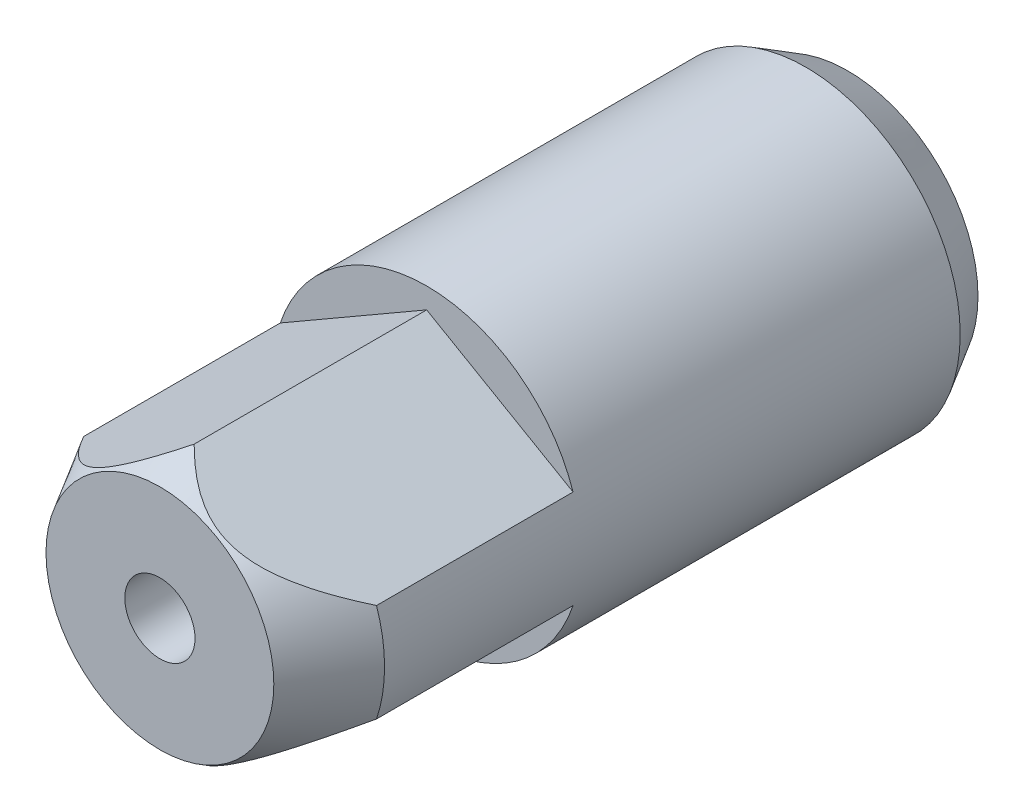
ISO-10303-21;
HEADER;
FILE_DESCRIPTION(('STEP AP214'),'2;1');
FILE_NAME('part.step','',(''),(''),'','','');
FILE_SCHEMA(('AUTOMOTIVE_DESIGN { 1 0 10303 214 1 1 1 1 }'));
ENDSEC;
DATA;
#1=APPLICATION_CONTEXT('core data for automotive mechanical design processes');
#2=APPLICATION_PROTOCOL_DEFINITION('international standard','automotive_design',2000,#1);
#3=PRODUCT_CONTEXT('',#1,'mechanical');
#4=PRODUCT('Part','Part','',(#3));
#5=PRODUCT_RELATED_PRODUCT_CATEGORY('part','',(#4));
#6=PRODUCT_DEFINITION_FORMATION('','',#4);
#7=PRODUCT_DEFINITION_CONTEXT('part definition',#1,'design');
#8=PRODUCT_DEFINITION('design','',#6,#7);
#9=PRODUCT_DEFINITION_SHAPE('','',#8);
#10=(LENGTH_UNIT() NAMED_UNIT(*) SI_UNIT(.MILLI.,.METRE.));
#11=(NAMED_UNIT(*) PLANE_ANGLE_UNIT() SI_UNIT($,.RADIAN.));
#12=(NAMED_UNIT(*) SI_UNIT($,.STERADIAN.) SOLID_ANGLE_UNIT());
#13=UNCERTAINTY_MEASURE_WITH_UNIT(LENGTH_MEASURE(1.E-05),#10,'distance_accuracy_value','');
#14=(GEOMETRIC_REPRESENTATION_CONTEXT(3) GLOBAL_UNCERTAINTY_ASSIGNED_CONTEXT((#13)) GLOBAL_UNIT_ASSIGNED_CONTEXT((#10,
#11,#12)) REPRESENTATION_CONTEXT('',''));
#15=CARTESIAN_POINT('',(0.,0.,0.));
#16=DIRECTION('',(0.,0.,1.));
#17=DIRECTION('',(1.,0.,0.));
#18=AXIS2_PLACEMENT_3D('',#15,#16,#17);
#19=CARTESIAN_POINT('',(0.,0.,44.));
#20=DIRECTION('',(0.,0.,-1.));
#21=DIRECTION('',(-1.,0.,0.));
#22=AXIS2_PLACEMENT_3D('',#19,#20,#21);
#23=CONICAL_SURFACE('',#22,11.,0.523598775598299);
#24=CARTESIAN_POINT('',(0.,0.,49.));
#25=DIRECTION('',(0.,0.,1.));
#26=DIRECTION('',(1.,0.,0.));
#27=AXIS2_PLACEMENT_3D('',#24,#25,#26);
#28=CIRCLE('',#27,8.11324865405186);
#29=CARTESIAN_POINT('',(8.11324865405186,0.,49.));
#30=VERTEX_POINT('',#29);
#31=EDGE_CURVE('E23',#30,#30,#28,.T.);
#32=ORIENTED_EDGE('',*,*,#31,.F.);
#33=EDGE_LOOP('',(#32));
#34=FACE_BOUND('',#33,.T.);
#35=CARTESIAN_POINT('',(-0.0002,9.52091275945,46.561854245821));
#36=CARTESIAN_POINT('',(0.0860249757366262,9.47113074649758,46.6480735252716));
#37=CARTESIAN_POINT('',(0.173110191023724,9.42085207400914,46.7331429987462));
#38=CARTESIAN_POINT('',(0.349190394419,9.31919212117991,46.9006618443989));
#39=CARTESIAN_POINT('',(0.438185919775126,9.26781053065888,46.9831104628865));
#40=CARTESIAN_POINT('',(0.709164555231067,9.11136094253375,47.2267956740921));
#41=CARTESIAN_POINT('',(0.894264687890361,9.00449333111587,47.3834860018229));
#42=CARTESIAN_POINT('',(1.27893484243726,8.782403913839,47.6847272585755));
#43=CARTESIAN_POINT('',(1.47875674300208,8.66703668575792,47.8288533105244));
#44=CARTESIAN_POINT('',(1.88922710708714,8.43005151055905,48.0941303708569));
#45=CARTESIAN_POINT('',(2.09985028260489,8.30844816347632,48.2153321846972));
#46=CARTESIAN_POINT('',(2.43365580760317,8.11572545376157,48.3790773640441));
#47=CARTESIAN_POINT('',(2.55292932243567,8.04686285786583,48.4322911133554));
#48=CARTESIAN_POINT('',(2.79459998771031,7.90733423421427,48.5284031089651));
#49=CARTESIAN_POINT('',(2.91699736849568,7.83666807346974,48.5713005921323));
#50=CARTESIAN_POINT('',(3.1634566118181,7.69437476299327,48.6451406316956));
#51=CARTESIAN_POINT('',(3.28749766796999,7.62275962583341,48.6761750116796));
#52=CARTESIAN_POINT('',(3.53744533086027,7.47845227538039,48.7256442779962));
#53=CARTESIAN_POINT('',(3.66335156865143,7.40576027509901,48.7440816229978));
#54=CARTESIAN_POINT('',(3.91731234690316,7.25913595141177,48.7677338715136));
#55=CARTESIAN_POINT('',(4.04537592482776,7.18519841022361,48.7728210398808));
#56=CARTESIAN_POINT('',(4.30135214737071,7.03741046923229,48.7691838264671));
#57=CARTESIAN_POINT('',(4.42926479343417,6.9635600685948,48.7604595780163));
#58=CARTESIAN_POINT('',(4.684082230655,6.81644115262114,48.7295470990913));
#59=CARTESIAN_POINT('',(4.81098482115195,6.74317390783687,48.7073349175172));
#60=CARTESIAN_POINT('',(5.06264079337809,6.59788026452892,48.6503198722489));
#61=CARTESIAN_POINT('',(5.18739385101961,6.52585405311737,48.6155151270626));
#62=CARTESIAN_POINT('',(5.46940994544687,6.36303198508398,48.5229371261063));
#63=CARTESIAN_POINT('',(5.62575581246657,6.27276565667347,48.4614409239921));
#64=CARTESIAN_POINT('',(5.93307167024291,6.09533676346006,48.3225351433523));
#65=CARTESIAN_POINT('',(6.08403828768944,6.00817614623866,48.245115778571));
#66=CARTESIAN_POINT('',(6.38165080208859,5.83634948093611,48.0764735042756));
#67=CARTESIAN_POINT('',(6.52824773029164,5.7517117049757,47.9851364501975));
#68=CARTESIAN_POINT('',(6.81591068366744,5.5856294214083,47.7916842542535));
#69=CARTESIAN_POINT('',(6.95697795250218,5.50418419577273,47.689571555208));
#70=CARTESIAN_POINT('',(7.25748890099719,5.3306841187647,47.4585691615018));
#71=CARTESIAN_POINT('',(7.41600158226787,5.2391667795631,47.3280726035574));
#72=CARTESIAN_POINT('',(7.72689739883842,5.05967099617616,47.0576449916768));
#73=CARTESIAN_POINT('',(7.87927857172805,4.97169368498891,46.917710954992));
#74=CARTESIAN_POINT('',(8.17897541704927,4.79866363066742,46.6300388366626));
#75=CARTESIAN_POINT('',(8.32627868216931,4.71361805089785,46.4822836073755));
#76=CARTESIAN_POINT('',(8.61616767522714,4.5462505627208,46.1807205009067));
#77=CARTESIAN_POINT('',(8.75875294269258,4.46392892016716,46.0269120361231));
#78=CARTESIAN_POINT('',(9.03345584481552,4.30532912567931,45.7214359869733));
#79=CARTESIAN_POINT('',(9.1657553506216,4.22894597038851,45.569985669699));
#80=CARTESIAN_POINT('',(9.42706872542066,4.07807662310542,45.2633417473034));
#81=CARTESIAN_POINT('',(9.55608239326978,4.00359054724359,45.1081479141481));
#82=CARTESIAN_POINT('',(9.81045397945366,3.85672904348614,44.7955601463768));
#83=CARTESIAN_POINT('',(9.93582909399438,3.78434368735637,44.6381848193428));
#84=CARTESIAN_POINT('',(10.1840139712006,3.64105408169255,44.3208180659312));
#85=CARTESIAN_POINT('',(10.3068242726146,3.57014952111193,44.1608272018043));
#86=CARTESIAN_POINT('',(10.4285268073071,3.49988452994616,43.9997352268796));
#87=B_SPLINE_CURVE_WITH_KNOTS('',3,(#35,#36,#37,#38,#39,#40,#41,#42,#43,#44,#45,#46,#47,#48,#49,
#50,#51,#52,#53,#54,#55,#56,#57,#58,#59,#60,#61,#62,#63,#64,#65,#66,#67,#68,#69,#70,#71,#72,#73,
#74,#75,#76,#77,#78,#79,#80,#81,#82,#83,#84,#85,#86),.UNSPECIFIED.,.F.,.F.,(4,2,2,2,2,2,2,2,2,2,
2,2,2,2,2,2,2,2,2,2,2,2,2,2,2,4),(0.,0.395103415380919,0.790319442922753,1.58477697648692,
2.40002064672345,3.21343581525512,3.65604476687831,4.09868644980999,4.53782903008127,
4.97688587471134,5.42012857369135,5.8633669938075,6.30739480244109,6.75148898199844,
7.3227165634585,7.89429627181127,8.47084475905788,9.0472628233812,9.72124464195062,
10.3954404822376,11.0711811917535,11.7469876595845,12.3922592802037,13.0375703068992,
13.6790381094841,14.3203697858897),.UNSPECIFIED.);
#88=CARTESIAN_POINT('',(0.,9.52079728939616,46.5620542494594));
#89=VERTEX_POINT('',#88);
#90=CARTESIAN_POINT('',(10.4283268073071,3.5,44.));
#91=VERTEX_POINT('',#90);
#92=EDGE_CURVE('E102',#89,#91,#87,.T.);
#93=ORIENTED_EDGE('',*,*,#92,.F.);
#94=CARTESIAN_POINT('',(0.0002,9.52091275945,46.561854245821));
#95=CARTESIAN_POINT('',(-0.0860249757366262,9.47113074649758,46.6480735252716));
#96=CARTESIAN_POINT('',(-0.173110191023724,9.42085207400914,46.7331429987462));
#97=CARTESIAN_POINT('',(-0.349190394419,9.31919212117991,46.9006618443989));
#98=CARTESIAN_POINT('',(-0.438185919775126,9.26781053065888,46.9831104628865));
#99=CARTESIAN_POINT('',(-0.709164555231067,9.11136094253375,47.2267956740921));
#100=CARTESIAN_POINT('',(-0.894264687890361,9.00449333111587,47.3834860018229));
#101=CARTESIAN_POINT('',(-1.27893484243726,8.782403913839,47.6847272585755));
#102=CARTESIAN_POINT('',(-1.47875674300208,8.66703668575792,47.8288533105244));
#103=CARTESIAN_POINT('',(-1.88922710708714,8.43005151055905,48.0941303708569));
#104=CARTESIAN_POINT('',(-2.09985028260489,8.30844816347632,48.2153321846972));
#105=CARTESIAN_POINT('',(-2.43365580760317,8.11572545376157,48.3790773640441));
#106=CARTESIAN_POINT('',(-2.55292932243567,8.04686285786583,48.4322911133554));
#107=CARTESIAN_POINT('',(-2.79459998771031,7.90733423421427,48.5284031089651));
#108=CARTESIAN_POINT('',(-2.91699736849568,7.83666807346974,48.5713005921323));
#109=CARTESIAN_POINT('',(-3.1634566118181,7.69437476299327,48.6451406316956));
#110=CARTESIAN_POINT('',(-3.28749766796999,7.62275962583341,48.6761750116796));
#111=CARTESIAN_POINT('',(-3.53744533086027,7.47845227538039,48.7256442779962));
#112=CARTESIAN_POINT('',(-3.66335156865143,7.40576027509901,48.7440816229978));
#113=CARTESIAN_POINT('',(-3.91731234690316,7.25913595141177,48.7677338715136));
#114=CARTESIAN_POINT('',(-4.04537592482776,7.18519841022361,48.7728210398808));
#115=CARTESIAN_POINT('',(-4.30135214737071,7.03741046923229,48.7691838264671));
#116=CARTESIAN_POINT('',(-4.42926479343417,6.9635600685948,48.7604595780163));
#117=CARTESIAN_POINT('',(-4.684082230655,6.81644115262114,48.7295470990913));
#118=CARTESIAN_POINT('',(-4.81098482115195,6.74317390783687,48.7073349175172));
#119=CARTESIAN_POINT('',(-5.06264079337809,6.59788026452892,48.6503198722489));
#120=CARTESIAN_POINT('',(-5.18739385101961,6.52585405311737,48.6155151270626));
#121=CARTESIAN_POINT('',(-5.46940994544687,6.36303198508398,48.5229371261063));
#122=CARTESIAN_POINT('',(-5.62575581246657,6.27276565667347,48.4614409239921));
#123=CARTESIAN_POINT('',(-5.93307167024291,6.09533676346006,48.3225351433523));
#124=CARTESIAN_POINT('',(-6.08403828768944,6.00817614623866,48.245115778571));
#125=CARTESIAN_POINT('',(-6.38165080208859,5.83634948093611,48.0764735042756));
#126=CARTESIAN_POINT('',(-6.52824773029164,5.7517117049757,47.9851364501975));
#127=CARTESIAN_POINT('',(-6.81591068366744,5.5856294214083,47.7916842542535));
#128=CARTESIAN_POINT('',(-6.95697795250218,5.50418419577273,47.689571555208));
#129=CARTESIAN_POINT('',(-7.25748890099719,5.3306841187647,47.4585691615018));
#130=CARTESIAN_POINT('',(-7.41600158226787,5.2391667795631,47.3280726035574));
#131=CARTESIAN_POINT('',(-7.72689739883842,5.05967099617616,47.0576449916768));
#132=CARTESIAN_POINT('',(-7.87927857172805,4.97169368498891,46.917710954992));
#133=CARTESIAN_POINT('',(-8.17897541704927,4.79866363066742,46.6300388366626));
#134=CARTESIAN_POINT('',(-8.32627868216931,4.71361805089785,46.4822836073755));
#135=CARTESIAN_POINT('',(-8.61616767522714,4.5462505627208,46.1807205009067));
#136=CARTESIAN_POINT('',(-8.75875294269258,4.46392892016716,46.0269120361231));
#137=CARTESIAN_POINT('',(-9.03345584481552,4.30532912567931,45.7214359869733));
#138=CARTESIAN_POINT('',(-9.1657553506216,4.22894597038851,45.569985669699));
#139=CARTESIAN_POINT('',(-9.42706872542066,4.07807662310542,45.2633417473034));
#140=CARTESIAN_POINT('',(-9.55608239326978,4.00359054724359,45.1081479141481));
#141=CARTESIAN_POINT('',(-9.81045397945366,3.85672904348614,44.7955601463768));
#142=CARTESIAN_POINT('',(-9.93582909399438,3.78434368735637,44.6381848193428));
#143=CARTESIAN_POINT('',(-10.1840139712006,3.64105408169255,44.3208180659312));
#144=CARTESIAN_POINT('',(-10.3068242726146,3.57014952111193,44.1608272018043));
#145=CARTESIAN_POINT('',(-10.4285268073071,3.49988452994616,43.9997352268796));
#146=B_SPLINE_CURVE_WITH_KNOTS('',3,(#94,#95,#96,#97,#98,#99,#100,#101,#102,#103,#104,#105,#106,
#107,#108,#109,#110,#111,#112,#113,#114,#115,#116,#117,#118,#119,#120,#121,#122,#123,#124,#125,
#126,#127,#128,#129,#130,#131,#132,#133,#134,#135,#136,#137,#138,#139,#140,#141,#142,#143,#144,
#145),.UNSPECIFIED.,.F.,.F.,(4,2,2,2,2,2,2,2,2,2,2,2,2,2,2,2,2,2,2,2,2,2,2,2,2,4),(0.,
0.395103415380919,0.790319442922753,1.58477697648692,2.40002064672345,3.21343581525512,
3.65604476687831,4.09868644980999,4.53782903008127,4.97688587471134,5.42012857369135,
5.8633669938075,6.30739480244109,6.75148898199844,7.3227165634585,7.89429627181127,
8.47084475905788,9.0472628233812,9.72124464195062,10.3954404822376,11.0711811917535,
11.7469876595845,12.3922592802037,13.0375703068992,13.6790381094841,14.3203697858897),.UNSPECIFIED.);
#147=CARTESIAN_POINT('',(-10.4283268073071,3.5,44.));
#148=VERTEX_POINT('',#147);
#149=EDGE_CURVE('E75',#89,#148,#146,.T.);
#150=ORIENTED_EDGE('',*,*,#149,.T.);
#151=CARTESIAN_POINT('',(0.,0.,44.));
#152=DIRECTION('',(0.,0.,1.));
#153=DIRECTION('',(1.,0.,0.));
#154=AXIS2_PLACEMENT_3D('',#151,#152,#153);
#155=CIRCLE('',#154,11.);
#156=CARTESIAN_POINT('',(-10.4283268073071,-3.5,44.));
#157=VERTEX_POINT('',#156);
#158=EDGE_CURVE('E155',#148,#157,#155,.T.);
#159=ORIENTED_EDGE('',*,*,#158,.T.);
#160=CARTESIAN_POINT('',(0.000199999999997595,-9.52091275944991,46.5618542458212));
#161=CARTESIAN_POINT('',(-0.0860249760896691,-9.4711307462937,46.6480735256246));
#162=CARTESIAN_POINT('',(-0.173110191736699,-9.42085207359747,46.7331429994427));
#163=CARTESIAN_POINT('',(-0.349190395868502,-9.31919212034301,46.9006618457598));
#164=CARTESIAN_POINT('',(-0.438185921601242,-9.26781052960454,46.9831104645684));
#165=CARTESIAN_POINT('',(-0.709164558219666,-9.11136094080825,47.2267956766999));
#166=CARTESIAN_POINT('',(-0.894264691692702,-9.00449332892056,47.3834860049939));
#167=CARTESIAN_POINT('',(-1.27893484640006,-8.78240391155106,47.6847272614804));
#168=CARTESIAN_POINT('',(-1.47875674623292,-8.66703668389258,47.8288533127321));
#169=CARTESIAN_POINT('',(-1.88922710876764,-8.43005150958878,48.0941303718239));
#170=CARTESIAN_POINT('',(-2.09985028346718,-8.30844816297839,48.2153321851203));
#171=CARTESIAN_POINT('',(-2.43365580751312,-8.11572545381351,48.379077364));
#172=CARTESIAN_POINT('',(-2.55292932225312,-8.04686285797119,48.432291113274));
#173=CARTESIAN_POINT('',(-2.79459998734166,-7.9073342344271,48.5284031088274));
#174=CARTESIAN_POINT('',(-2.91699736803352,-7.83666807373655,48.5713005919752));
#175=CARTESIAN_POINT('',(-3.16345661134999,-7.69437476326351,48.6451406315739));
#176=CARTESIAN_POINT('',(-3.28749766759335,-7.62275962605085,48.6761750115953));
#177=CARTESIAN_POINT('',(-3.53744533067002,-7.4784522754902,48.7256442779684));
#178=CARTESIAN_POINT('',(-3.6633515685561,-7.405760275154,48.744081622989));
#179=CARTESIAN_POINT('',(-3.91731234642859,-7.25913595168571,48.7677338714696));
#180=CARTESIAN_POINT('',(-4.04537592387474,-7.18519841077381,48.7728210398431));
#181=CARTESIAN_POINT('',(-4.30135214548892,-7.03741047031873,48.7691838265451));
#182=CARTESIAN_POINT('',(-4.42926479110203,-6.96356006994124,48.760459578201));
#183=CARTESIAN_POINT('',(-4.68408222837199,-6.81644115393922,48.7295470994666));
#184=CARTESIAN_POINT('',(-4.81098481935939,-6.74317390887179,48.7073349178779));
#185=CARTESIAN_POINT('',(-5.06264079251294,-6.5978802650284,48.6503198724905));
#186=CARTESIAN_POINT('',(-5.18739385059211,-6.52585405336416,48.6155151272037));
#187=CARTESIAN_POINT('',(-5.46940995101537,-6.36303198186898,48.5229371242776));
#188=CARTESIAN_POINT('',(-5.62575582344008,-6.2727656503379,48.4614409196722));
#189=CARTESIAN_POINT('',(-5.93307169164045,-6.09533675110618,48.3225351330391));
#190=CARTESIAN_POINT('',(-6.08403831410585,-6.00817613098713,48.2451157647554));
#191=CARTESIAN_POINT('',(-6.38165082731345,-5.83634946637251,48.0764734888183));
#192=CARTESIAN_POINT('',(-6.52824774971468,-5.7517116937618,47.9851364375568));
#193=CARTESIAN_POINT('',(-6.81591069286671,-5.58562941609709,47.7916842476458));
#194=CARTESIAN_POINT('',(-6.95697795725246,-5.50418419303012,47.6895715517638));
#195=CARTESIAN_POINT('',(-7.25748618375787,-5.33068568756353,47.458571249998));
#196=CARTESIAN_POINT('',(-7.41599626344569,-5.23916985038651,47.3280769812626));
#197=CARTESIAN_POINT('',(-7.72688706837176,-5.05967696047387,47.0576542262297));
#198=CARTESIAN_POINT('',(-7.87926583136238,-4.97170104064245,46.9177227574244));
#199=CARTESIAN_POINT('',(-8.1789579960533,-4.79867368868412,46.630055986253));
#200=CARTESIAN_POINT('',(-8.32625899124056,-4.71362941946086,46.4823035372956));
#201=CARTESIAN_POINT('',(-8.61614357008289,-4.54626447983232,46.1807461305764));
#202=CARTESIAN_POINT('',(-8.75872669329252,-4.46394407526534,46.0269405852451));
#203=CARTESIAN_POINT('',(-9.03342564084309,-4.30534656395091,45.7214701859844));
#204=CARTESIAN_POINT('',(-9.16572332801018,-4.22896445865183,45.5700225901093));
#205=CARTESIAN_POINT('',(-9.42703313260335,-4.07809717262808,45.263384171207));
#206=CARTESIAN_POINT('',(-9.55604504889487,-4.0036121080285,45.1081931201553));
#207=CARTESIAN_POINT('',(-9.81041322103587,-3.85675257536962,44.7956109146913));
#208=CARTESIAN_POINT('',(-9.9357866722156,-3.78436817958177,44.6382383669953));
#209=CARTESIAN_POINT('',(-10.1839682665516,-3.64108046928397,44.320877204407));
#210=CARTESIAN_POINT('',(-10.3067769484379,-3.57017684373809,44.1608891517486));
#211=CARTESIAN_POINT('',(-10.4284778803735,-3.49991277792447,43.9998));
#212=B_SPLINE_CURVE_WITH_KNOTS('',3,(#160,#161,#162,#163,#164,#165,#166,#167,#168,#169,#170,
#171,#172,#173,#174,#175,#176,#177,#178,#179,#180,#181,#182,#183,#184,#185,#186,#187,#188,#189,
#190,#191,#192,#193,#194,#195,#196,#197,#198,#199,#200,#201,#202,#203,#204,#205,#206,#207,#208,
#209,#210,#211),.UNSPECIFIED.,.F.,.F.,(4,2,2,2,2,2,2,2,2,2,2,2,2,2,2,2,2,2,2,2,2,2,2,2,2,4),(0.,
0.39510341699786,0.79031944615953,1.58477698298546,2.40002064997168,3.21343581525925,
3.65604476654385,4.09868644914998,4.53782902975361,4.97688587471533,5.42012857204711,
5.86336699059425,6.30739480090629,6.75148898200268,7.32271658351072,7.89429631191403,
8.47084477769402,9.04726282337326,9.72123333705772,10.3954178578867,11.071147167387,
11.7469422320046,12.3922036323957,13.0375044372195,13.6789622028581,14.3202838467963),.UNSPECIFIED.);
#213=CARTESIAN_POINT('',(0.,-9.52079728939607,46.5620542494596));
#214=VERTEX_POINT('',#213);
#215=EDGE_CURVE('E129',#214,#157,#212,.T.);
#216=ORIENTED_EDGE('',*,*,#215,.F.);
#217=CARTESIAN_POINT('',(-0.000200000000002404,-9.52091275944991,46.5618542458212));
#218=CARTESIAN_POINT('',(0.0860249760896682,-9.47113074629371,46.6480735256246));
#219=CARTESIAN_POINT('',(0.173110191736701,-9.42085207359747,46.7331429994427));
#220=CARTESIAN_POINT('',(0.349190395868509,-9.31919212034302,46.9006618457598));
#221=CARTESIAN_POINT('',(0.438185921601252,-9.26781052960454,46.9831104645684));
#222=CARTESIAN_POINT('',(0.709164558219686,-9.11136094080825,47.2267956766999));
#223=CARTESIAN_POINT('',(0.894264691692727,-9.00449332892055,47.383486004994));
#224=CARTESIAN_POINT('',(1.2789348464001,-8.78240391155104,47.6847272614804));
#225=CARTESIAN_POINT('',(1.47875674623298,-8.66703668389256,47.8288533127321));
#226=CARTESIAN_POINT('',(1.88922710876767,-8.43005150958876,48.0941303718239));
#227=CARTESIAN_POINT('',(2.09985028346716,-8.3084481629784,48.2153321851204));
#228=CARTESIAN_POINT('',(2.43365580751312,-8.11572545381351,48.3790773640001));
#229=CARTESIAN_POINT('',(2.55292932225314,-8.04686285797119,48.432291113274));
#230=CARTESIAN_POINT('',(2.79459998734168,-7.9073342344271,48.5284031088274));
#231=CARTESIAN_POINT('',(2.91699736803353,-7.83666807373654,48.5713005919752));
#232=CARTESIAN_POINT('',(3.16345661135,-7.69437476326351,48.6451406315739));
#233=CARTESIAN_POINT('',(3.28749766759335,-7.62275962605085,48.6761750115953));
#234=CARTESIAN_POINT('',(3.53744533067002,-7.4784522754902,48.7256442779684));
#235=CARTESIAN_POINT('',(3.6633515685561,-7.405760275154,48.744081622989));
#236=CARTESIAN_POINT('',(3.91731234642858,-7.25913595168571,48.7677338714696));
#237=CARTESIAN_POINT('',(4.04537592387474,-7.18519841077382,48.7728210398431));
#238=CARTESIAN_POINT('',(4.30135214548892,-7.03741047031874,48.7691838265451));
#239=CARTESIAN_POINT('',(4.42926479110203,-6.96356006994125,48.760459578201));
#240=CARTESIAN_POINT('',(4.68408222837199,-6.81644115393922,48.7295470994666));
#241=CARTESIAN_POINT('',(4.81098481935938,-6.7431739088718,48.7073349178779));
#242=CARTESIAN_POINT('',(5.06264079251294,-6.59788026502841,48.6503198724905));
#243=CARTESIAN_POINT('',(5.1873938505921,-6.52585405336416,48.6155151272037));
#244=CARTESIAN_POINT('',(5.46940995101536,-6.36303198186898,48.5229371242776));
#245=CARTESIAN_POINT('',(5.62575582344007,-6.2727656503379,48.4614409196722));
#246=CARTESIAN_POINT('',(5.93307169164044,-6.09533675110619,48.3225351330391));
#247=CARTESIAN_POINT('',(6.08403831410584,-6.00817613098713,48.2451157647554));
#248=CARTESIAN_POINT('',(6.38165082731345,-5.83634946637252,48.0764734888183));
#249=CARTESIAN_POINT('',(6.52824774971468,-5.7517116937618,47.9851364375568));
#250=CARTESIAN_POINT('',(6.8159106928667,-5.5856294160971,47.7916842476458));
#251=CARTESIAN_POINT('',(6.95697795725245,-5.50418419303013,47.6895715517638));
#252=CARTESIAN_POINT('',(7.25748618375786,-5.33068568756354,47.458571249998));
#253=CARTESIAN_POINT('',(7.41599626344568,-5.23916985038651,47.3280769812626));
#254=CARTESIAN_POINT('',(7.72688706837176,-5.05967696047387,47.0576542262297));
#255=CARTESIAN_POINT('',(7.87926583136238,-4.97170104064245,46.9177227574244));
#256=CARTESIAN_POINT('',(8.1789579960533,-4.79867368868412,46.6300559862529));
#257=CARTESIAN_POINT('',(8.32625899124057,-4.71362941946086,46.4823035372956));
#258=CARTESIAN_POINT('',(8.6161435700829,-4.54626447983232,46.1807461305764));
#259=CARTESIAN_POINT('',(8.75872669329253,-4.46394407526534,46.026940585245));
#260=CARTESIAN_POINT('',(9.0334256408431,-4.30534656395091,45.7214701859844));
#261=CARTESIAN_POINT('',(9.16572332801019,-4.22896445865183,45.5700225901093));
#262=CARTESIAN_POINT('',(9.42703313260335,-4.07809717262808,45.263384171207));
#263=CARTESIAN_POINT('',(9.55604504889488,-4.00361210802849,45.1081931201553));
#264=CARTESIAN_POINT('',(9.81041322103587,-3.85675257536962,44.7956109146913));
#265=CARTESIAN_POINT('',(9.9357866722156,-3.78436817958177,44.6382383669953));
#266=CARTESIAN_POINT('',(10.1839682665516,-3.64108046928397,44.320877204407));
#267=CARTESIAN_POINT('',(10.3067769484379,-3.57017684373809,44.1608891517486));
#268=CARTESIAN_POINT('',(10.4284778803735,-3.49991277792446,43.9998));
#269=B_SPLINE_CURVE_WITH_KNOTS('',3,(#217,#218,#219,#220,#221,#222,#223,#224,#225,#226,#227,
#228,#229,#230,#231,#232,#233,#234,#235,#236,#237,#238,#239,#240,#241,#242,#243,#244,#245,#246,
#247,#248,#249,#250,#251,#252,#253,#254,#255,#256,#257,#258,#259,#260,#261,#262,#263,#264,#265,
#266,#267,#268),.UNSPECIFIED.,.F.,.F.,(4,2,2,2,2,2,2,2,2,2,2,2,2,2,2,2,2,2,2,2,2,2,2,2,2,4),(0.,
0.39510341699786,0.790319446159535,1.5847769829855,2.40002064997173,3.2134358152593,
3.65604476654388,4.09868644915,4.53782902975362,4.97688587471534,5.42012857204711,
5.86336699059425,6.30739480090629,6.75148898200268,7.32271658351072,7.89429631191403,
8.47084477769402,9.04726282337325,9.72123333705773,10.3954178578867,11.071147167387,
11.7469422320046,12.3922036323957,13.0375044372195,13.6789622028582,14.3202838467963),.UNSPECIFIED.);
#270=CARTESIAN_POINT('',(10.4283268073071,-3.5,44.));
#271=VERTEX_POINT('',#270);
#272=EDGE_CURVE('E138',#214,#271,#269,.T.);
#273=ORIENTED_EDGE('',*,*,#272,.T.);
#274=EDGE_CURVE('E156',#271,#91,#155,.T.);
#275=ORIENTED_EDGE('',*,*,#274,.T.);
#276=EDGE_LOOP('',(#93,#150,#159,#216,#273,#275));
#277=FACE_BOUND('',#276,.T.);
#278=ADVANCED_FACE('F15',(#34,#277),#23,.T.);
#279=CARTESIAN_POINT('',(0.,0.,30.));
#280=DIRECTION('',(0.,0.,1.));
#281=DIRECTION('',(1.,0.,0.));
#282=AXIS2_PLACEMENT_3D('',#279,#280,#281);
#283=CYLINDRICAL_SURFACE('',#282,11.);
#284=CARTESIAN_POINT('',(0.,0.,3.));
#285=DIRECTION('',(0.,0.,1.));
#286=DIRECTION('',(1.,0.,0.));
#287=AXIS2_PLACEMENT_3D('',#284,#285,#286);
#288=CIRCLE('',#287,11.);
#289=CARTESIAN_POINT('',(11.,0.,3.));
#290=VERTEX_POINT('',#289);
#291=EDGE_CURVE('E152',#290,#290,#288,.T.);
#292=ORIENTED_EDGE('',*,*,#291,.T.);
#293=EDGE_LOOP('',(#292));
#294=FACE_BOUND('',#293,.T.);
#295=DIRECTION('',(0.,0.,1.));
#296=VECTOR('',#295,1.);
#297=CARTESIAN_POINT('',(10.4283268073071,3.5,30.));
#298=LINE('',#297,#296);
#299=CARTESIAN_POINT('',(10.4283268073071,3.5,30.));
#300=VERTEX_POINT('',#299);
#301=EDGE_CURVE('E82',#300,#91,#298,.T.);
#302=ORIENTED_EDGE('',*,*,#301,.T.);
#303=ORIENTED_EDGE('',*,*,#274,.F.);
#304=DIRECTION('',(0.,0.,1.));
#305=VECTOR('',#304,1.);
#306=CARTESIAN_POINT('',(10.4283268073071,-3.5,30.));
#307=LINE('',#306,#305);
#308=CARTESIAN_POINT('',(10.4283268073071,-3.5,30.));
#309=VERTEX_POINT('',#308);
#310=EDGE_CURVE('E179',#309,#271,#307,.T.);
#311=ORIENTED_EDGE('',*,*,#310,.F.);
#312=CARTESIAN_POINT('',(0.,0.,30.));
#313=DIRECTION('',(0.,0.,1.));
#314=DIRECTION('',(1.,0.,0.));
#315=AXIS2_PLACEMENT_3D('',#312,#313,#314);
#316=CIRCLE('',#315,11.);
#317=CARTESIAN_POINT('',(-10.4283268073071,-3.5,30.));
#318=VERTEX_POINT('',#317);
#319=EDGE_CURVE('E169',#318,#309,#316,.T.);
#320=ORIENTED_EDGE('',*,*,#319,.F.);
#321=DIRECTION('',(0.,0.,1.));
#322=VECTOR('',#321,1.);
#323=CARTESIAN_POINT('',(-10.4283268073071,-3.5,30.));
#324=LINE('',#323,#322);
#325=EDGE_CURVE('E176',#318,#157,#324,.T.);
#326=ORIENTED_EDGE('',*,*,#325,.T.);
#327=ORIENTED_EDGE('',*,*,#158,.F.);
#328=DIRECTION('',(0.,0.,1.));
#329=VECTOR('',#328,1.);
#330=CARTESIAN_POINT('',(-10.4283268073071,3.5,30.));
#331=LINE('',#330,#329);
#332=CARTESIAN_POINT('',(-10.4283268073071,3.5,30.));
#333=VERTEX_POINT('',#332);
#334=EDGE_CURVE('E78',#333,#148,#331,.T.);
#335=ORIENTED_EDGE('',*,*,#334,.F.);
#336=CARTESIAN_POINT('',(0.,0.,30.));
#337=DIRECTION('',(0.,0.,1.));
#338=DIRECTION('',(1.,0.,0.));
#339=AXIS2_PLACEMENT_3D('',#336,#337,#338);
#340=CIRCLE('',#339,11.);
#341=EDGE_CURVE('E86',#300,#333,#340,.T.);
#342=ORIENTED_EDGE('',*,*,#341,.F.);
#343=EDGE_LOOP('',(#302,#303,#311,#320,#326,#327,#335,#342));
#344=FACE_BOUND('',#343,.T.);
#345=ADVANCED_FACE('F165',(#294,#344),#283,.T.);
#346=CARTESIAN_POINT('',(0.,0.,30.));
#347=DIRECTION('',(0.,0.,1.));
#348=DIRECTION('',(1.,0.,0.));
#349=AXIS2_PLACEMENT_3D('',#346,#347,#348);
#350=CYLINDRICAL_SURFACE('',#349,2.5);
#351=CARTESIAN_POINT('',(0.,0.,39.));
#352=DIRECTION('',(0.,0.,1.));
#353=DIRECTION('',(1.,0.,0.));
#354=AXIS2_PLACEMENT_3D('',#351,#352,#353);
#355=CIRCLE('',#354,2.5);
#356=CARTESIAN_POINT('',(2.5,0.,39.));
#357=VERTEX_POINT('',#356);
#358=EDGE_CURVE('E89',#357,#357,#355,.T.);
#359=ORIENTED_EDGE('',*,*,#358,.F.);
#360=EDGE_LOOP('',(#359));
#361=FACE_BOUND('',#360,.T.);
#362=CARTESIAN_POINT('',(0.,0.,49.));
#363=DIRECTION('',(0.,0.,1.));
#364=DIRECTION('',(1.,0.,0.));
#365=AXIS2_PLACEMENT_3D('',#362,#363,#364);
#366=CIRCLE('',#365,2.5);
#367=CARTESIAN_POINT('',(2.5,0.,49.));
#368=VERTEX_POINT('',#367);
#369=EDGE_CURVE('E9',#368,#368,#366,.T.);
#370=ORIENTED_EDGE('',*,*,#369,.T.);
#371=EDGE_LOOP('',(#370));
#372=FACE_BOUND('',#371,.T.);
#373=ADVANCED_FACE('F17',(#361,#372),#350,.F.);
#374=CARTESIAN_POINT('',(8.11324865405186,0.,49.));
#375=DIRECTION('',(0.,0.,-1.));
#376=DIRECTION('',(-1.,0.,0.));
#377=AXIS2_PLACEMENT_3D('',#374,#375,#376);
#378=PLANE('',#377);
#379=ORIENTED_EDGE('',*,*,#369,.F.);
#380=EDGE_LOOP('',(#379));
#381=FACE_BOUND('',#380,.T.);
#382=ORIENTED_EDGE('',*,*,#31,.T.);
#383=EDGE_LOOP('',(#382));
#384=FACE_BOUND('',#383,.T.);
#385=ADVANCED_FACE('F161',(#381,#384),#378,.F.);
#386=CARTESIAN_POINT('',(0.,0.,0.));
#387=DIRECTION('',(0.,0.,1.));
#388=DIRECTION('',(1.,0.,0.));
#389=AXIS2_PLACEMENT_3D('',#386,#387,#388);
#390=CONICAL_SURFACE('',#389,9.26794919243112,0.523598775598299);
#391=ORIENTED_EDGE('',*,*,#291,.F.);
#392=EDGE_LOOP('',(#391));
#393=FACE_BOUND('',#392,.T.);
#394=CARTESIAN_POINT('',(0.,0.,0.));
#395=DIRECTION('',(0.,0.,1.));
#396=DIRECTION('',(1.,0.,0.));
#397=AXIS2_PLACEMENT_3D('',#394,#395,#396);
#398=CIRCLE('',#397,9.26794919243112);
#399=CARTESIAN_POINT('',(9.26794919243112,0.,0.));
#400=VERTEX_POINT('',#399);
#401=EDGE_CURVE('E149',#400,#400,#398,.T.);
#402=ORIENTED_EDGE('',*,*,#401,.T.);
#403=EDGE_LOOP('',(#402));
#404=FACE_BOUND('',#403,.T.);
#405=ADVANCED_FACE('F252',(#393,#404),#390,.T.);
#406=CARTESIAN_POINT('',(1.,0.,0.));
#407=DIRECTION('',(0.,0.,1.));
#408=DIRECTION('',(1.,0.,0.));
#409=AXIS2_PLACEMENT_3D('',#406,#407,#408);
#410=PLANE('',#409);
#411=ORIENTED_EDGE('',*,*,#401,.F.);
#412=EDGE_LOOP('',(#411));
#413=FACE_BOUND('',#412,.T.);
#414=CARTESIAN_POINT('',(0.,0.,0.));
#415=DIRECTION('',(0.,0.,1.));
#416=DIRECTION('',(1.,0.,0.));
#417=AXIS2_PLACEMENT_3D('',#414,#415,#416);
#418=CIRCLE('',#417,1.);
#419=CARTESIAN_POINT('',(1.,0.,0.));
#420=VERTEX_POINT('',#419);
#421=EDGE_CURVE('E146',#420,#420,#418,.T.);
#422=ORIENTED_EDGE('',*,*,#421,.T.);
#423=EDGE_LOOP('',(#422));
#424=FACE_BOUND('',#423,.T.);
#425=ADVANCED_FACE('F257',(#413,#424),#410,.F.);
#426=CARTESIAN_POINT('',(0.,0.,30.));
#427=DIRECTION('',(0.,0.,1.));
#428=DIRECTION('',(1.,0.,0.));
#429=AXIS2_PLACEMENT_3D('',#426,#427,#428);
#430=CYLINDRICAL_SURFACE('',#429,1.);
#431=ORIENTED_EDGE('',*,*,#421,.F.);
#432=EDGE_LOOP('',(#431));
#433=FACE_BOUND('',#432,.T.);
#434=CARTESIAN_POINT('',(0.,0.,4.));
#435=DIRECTION('',(0.,0.,1.));
#436=DIRECTION('',(1.,0.,0.));
#437=AXIS2_PLACEMENT_3D('',#434,#435,#436);
#438=CIRCLE('',#437,1.);
#439=CARTESIAN_POINT('',(1.,0.,4.));
#440=VERTEX_POINT('',#439);
#441=EDGE_CURVE('E137',#440,#440,#438,.T.);
#442=ORIENTED_EDGE('',*,*,#441,.T.);
#443=EDGE_LOOP('',(#442));
#444=FACE_BOUND('',#443,.T.);
#445=ADVANCED_FACE('F266',(#433,#444),#430,.F.);
#446=CARTESIAN_POINT('',(0.,0.,4.));
#447=DIRECTION('',(0.,0.,1.));
#448=DIRECTION('',(1.,0.,0.));
#449=AXIS2_PLACEMENT_3D('',#446,#447,#448);
#450=PLANE('',#449);
#451=ORIENTED_EDGE('',*,*,#441,.F.);
#452=EDGE_LOOP('',(#451));
#453=FACE_BOUND('',#452,.T.);
#454=ADVANCED_FACE('F124',(#453),#450,.F.);
#455=CARTESIAN_POINT('',(-10.4283268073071,-3.5,30.));
#456=DIRECTION('',(-0.5,-0.866025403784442,0.));
#457=DIRECTION('',(0.866025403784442,-0.5,0.));
#458=AXIS2_PLACEMENT_3D('',#455,#456,#457);
#459=PLANE('',#458);
#460=ORIENTED_EDGE('',*,*,#215,.T.);
#461=ORIENTED_EDGE('',*,*,#325,.F.);
#462=DIRECTION('',(0.866025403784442,-0.5,0.));
#463=VECTOR('',#462,1.);
#464=CARTESIAN_POINT('',(-10.4283268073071,-3.5,30.));
#465=LINE('',#464,#463);
#466=CARTESIAN_POINT('',(0.,-9.52079728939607,30.));
#467=VERTEX_POINT('',#466);
#468=EDGE_CURVE('E38',#318,#467,#465,.T.);
#469=ORIENTED_EDGE('',*,*,#468,.T.);
#470=DIRECTION('',(0.,0.,1.));
#471=VECTOR('',#470,1.);
#472=CARTESIAN_POINT('',(0.,-9.52079728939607,30.));
#473=LINE('',#472,#471);
#474=EDGE_CURVE('E180',#467,#214,#473,.T.);
#475=ORIENTED_EDGE('',*,*,#474,.T.);
#476=EDGE_LOOP('',(#460,#461,#469,#475));
#477=FACE_BOUND('',#476,.T.);
#478=ADVANCED_FACE('F120',(#477),#459,.T.);
#479=CARTESIAN_POINT('',(10.4283268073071,-3.5,30.));
#480=DIRECTION('',(-0.5,0.866025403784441,0.));
#481=DIRECTION('',(-0.866025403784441,-0.5,0.));
#482=AXIS2_PLACEMENT_3D('',#479,#480,#481);
#483=PLANE('',#482);
#484=ORIENTED_EDGE('',*,*,#474,.F.);
#485=DIRECTION('',(-0.866025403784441,-0.5,0.));
#486=VECTOR('',#485,1.);
#487=CARTESIAN_POINT('',(10.4283268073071,-3.5,30.));
#488=LINE('',#487,#486);
#489=EDGE_CURVE('E170',#309,#467,#488,.T.);
#490=ORIENTED_EDGE('',*,*,#489,.F.);
#491=ORIENTED_EDGE('',*,*,#310,.T.);
#492=ORIENTED_EDGE('',*,*,#272,.F.);
#493=EDGE_LOOP('',(#484,#490,#491,#492));
#494=FACE_BOUND('',#493,.T.);
#495=ADVANCED_FACE('F119',(#494),#483,.F.);
#496=CARTESIAN_POINT('',(0.,0.,30.));
#497=DIRECTION('',(0.,0.,1.));
#498=DIRECTION('',(1.,0.,0.));
#499=AXIS2_PLACEMENT_3D('',#496,#497,#498);
#500=PLANE('',#499);
#501=ORIENTED_EDGE('',*,*,#468,.F.);
#502=ORIENTED_EDGE('',*,*,#319,.T.);
#503=ORIENTED_EDGE('',*,*,#489,.T.);
#504=EDGE_LOOP('',(#501,#502,#503));
#505=FACE_BOUND('',#504,.T.);
#506=ADVANCED_FACE('F116',(#505),#500,.T.);
#507=CARTESIAN_POINT('',(10.4283268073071,3.5,30.));
#508=DIRECTION('',(0.5,0.866025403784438,0.));
#509=DIRECTION('',(-0.866025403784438,0.5,0.));
#510=AXIS2_PLACEMENT_3D('',#507,#508,#509);
#511=PLANE('',#510);
#512=ORIENTED_EDGE('',*,*,#92,.T.);
#513=ORIENTED_EDGE('',*,*,#301,.F.);
#514=DIRECTION('',(-0.866025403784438,0.5,0.));
#515=VECTOR('',#514,1.);
#516=CARTESIAN_POINT('',(10.4283268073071,3.5,30.));
#517=LINE('',#516,#515);
#518=CARTESIAN_POINT('',(0.,9.52079728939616,30.));
#519=VERTEX_POINT('',#518);
#520=EDGE_CURVE('E30',#300,#519,#517,.T.);
#521=ORIENTED_EDGE('',*,*,#520,.T.);
#522=DIRECTION('',(0.,0.,1.));
#523=VECTOR('',#522,1.);
#524=CARTESIAN_POINT('',(0.,9.52079728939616,30.));
#525=LINE('',#524,#523);
#526=EDGE_CURVE('E71',#519,#89,#525,.T.);
#527=ORIENTED_EDGE('',*,*,#526,.T.);
#528=EDGE_LOOP('',(#512,#513,#521,#527));
#529=FACE_BOUND('',#528,.T.);
#530=ADVANCED_FACE('F80',(#529),#511,.T.);
#531=CARTESIAN_POINT('',(-10.4283268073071,3.5,30.));
#532=DIRECTION('',(0.5,-0.866025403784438,0.));
#533=DIRECTION('',(0.866025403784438,0.5,0.));
#534=AXIS2_PLACEMENT_3D('',#531,#532,#533);
#535=PLANE('',#534);
#536=ORIENTED_EDGE('',*,*,#526,.F.);
#537=DIRECTION('',(0.866025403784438,0.5,0.));
#538=VECTOR('',#537,1.);
#539=CARTESIAN_POINT('',(-10.4283268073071,3.5,30.));
#540=LINE('',#539,#538);
#541=EDGE_CURVE('E73',#333,#519,#540,.T.);
#542=ORIENTED_EDGE('',*,*,#541,.F.);
#543=ORIENTED_EDGE('',*,*,#334,.T.);
#544=ORIENTED_EDGE('',*,*,#149,.F.);
#545=EDGE_LOOP('',(#536,#542,#543,#544));
#546=FACE_BOUND('',#545,.T.);
#547=ADVANCED_FACE('F72',(#546),#535,.F.);
#548=CARTESIAN_POINT('',(0.,0.,30.));
#549=DIRECTION('',(0.,0.,1.));
#550=DIRECTION('',(1.,0.,0.));
#551=AXIS2_PLACEMENT_3D('',#548,#549,#550);
#552=PLANE('',#551);
#553=ORIENTED_EDGE('',*,*,#520,.F.);
#554=ORIENTED_EDGE('',*,*,#341,.T.);
#555=ORIENTED_EDGE('',*,*,#541,.T.);
#556=EDGE_LOOP('',(#553,#554,#555));
#557=FACE_BOUND('',#556,.T.);
#558=ADVANCED_FACE('F85',(#557),#552,.T.);
#559=CARTESIAN_POINT('',(0.,0.,39.));
#560=DIRECTION('',(0.,0.,1.));
#561=DIRECTION('',(1.,0.,0.));
#562=AXIS2_PLACEMENT_3D('',#559,#560,#561);
#563=PLANE('',#562);
#564=ORIENTED_EDGE('',*,*,#358,.T.);
#565=EDGE_LOOP('',(#564));
#566=FACE_BOUND('',#565,.T.);
#567=ADVANCED_FACE('F217',(#566),#563,.T.);
#568=CLOSED_SHELL('',(#278,#345,#373,#385,#405,#425,#445,#454,#478,#495,#506,#530,#547,#558,#567));
#569=MANIFOLD_SOLID_BREP('B1',#568);
#570=ADVANCED_BREP_SHAPE_REPRESENTATION('',(#18,#569),#14);
#571=SHAPE_DEFINITION_REPRESENTATION(#9,#570);
ENDSEC;
END-ISO-10303-21;
